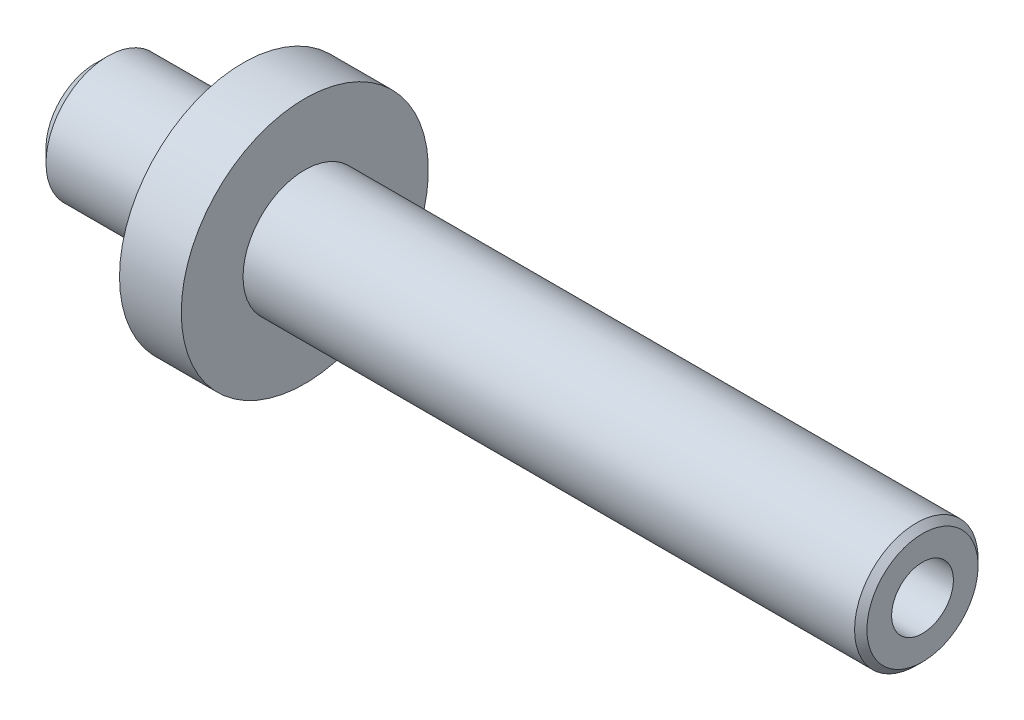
from build123d import *

# Parameters (mm, degrees)
CHANFREIN1_SIZE       = 1.05
CHANFREIN2_SIZE       = 0.5
TROU_TARAUD_M61_D     = 5
TROU_TARAUD_M61_DEPTH = 17
TROU_TARAUD_M61_TIP   = 1.502151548


with BuildPart() as part:
    # Esquisse1 → R_volution1 (revolve)
    with BuildSketch(Plane.XY, mode=Mode.PRIVATE) as r_volution1_sk:
        Polygon((-53.300312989, 0), (-53.300312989, 5), (-41.300312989, 5), (-41.300312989, 10), (-36.300312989, 10), (-36.300312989, 5), (13.699687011, 5), (13.699687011, 0), align=None)
    revolve(r_volution1_sk.sketch.rotate(Axis((-65.454303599, 0, 0), (1, 0, 0)), 90), axis=Axis((-65.454303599, 0, 0), (1, 0, 0)))

    # Chanfrein1
    chanfrein1_edges = [part.edges().sort_by_distance(p)[0] for p in [
        (-53.300312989, 0, -5),
    ]]
    chamfer(chanfrein1_edges, length=CHANFREIN1_SIZE)

    # Chanfrein2
    chanfrein2_edges = [part.edges().sort_by_distance(p)[0] for p in [
        (13.699687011, 0, -5),
    ]]
    chamfer(chanfrein2_edges, length=CHANFREIN2_SIZE)

    # Trou taraud_ M61
    with Locations(Plane(origin=(13.699687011, 0, 0), x_dir=(0, 0, -1), z_dir=(1, 0, 0))):
        with Locations((0, 0)):
            Hole(TROU_TARAUD_M61_D / 2, depth=TROU_TARAUD_M61_DEPTH)
            with Locations((0, 0, -(TROU_TARAUD_M61_DEPTH + TROU_TARAUD_M61_TIP / 2))):  # 118° drill point
                Cone(0, TROU_TARAUD_M61_D / 2, TROU_TARAUD_M61_TIP, mode=Mode.SUBTRACT)


solid = part.part
